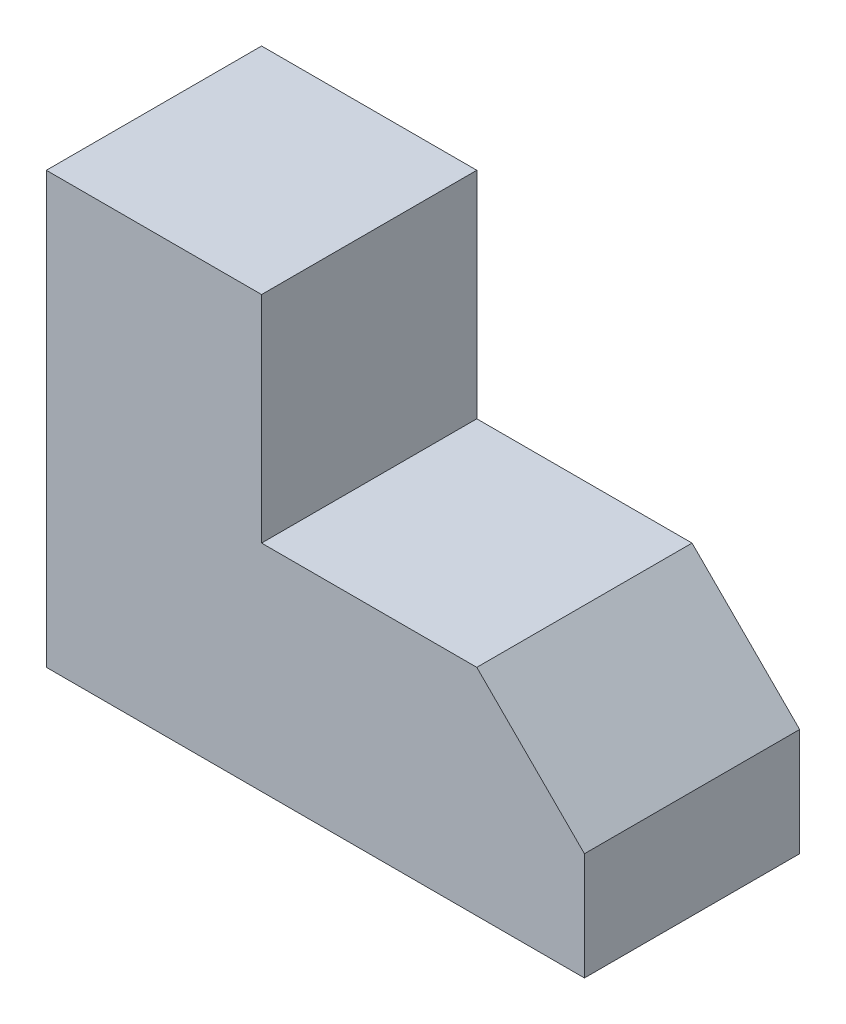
ISO-10303-21;
HEADER;
FILE_DESCRIPTION(('STEP AP214'),'2;1');
FILE_NAME('part.step','',(''),(''),'','','');
FILE_SCHEMA(('AUTOMOTIVE_DESIGN { 1 0 10303 214 1 1 1 1 }'));
ENDSEC;
DATA;
#1=APPLICATION_CONTEXT('core data for automotive mechanical design processes');
#2=APPLICATION_PROTOCOL_DEFINITION('international standard','automotive_design',2000,#1);
#3=PRODUCT_CONTEXT('',#1,'mechanical');
#4=PRODUCT('Part','Part','',(#3));
#5=PRODUCT_RELATED_PRODUCT_CATEGORY('part','',(#4));
#6=PRODUCT_DEFINITION_FORMATION('','',#4);
#7=PRODUCT_DEFINITION_CONTEXT('part definition',#1,'design');
#8=PRODUCT_DEFINITION('design','',#6,#7);
#9=PRODUCT_DEFINITION_SHAPE('','',#8);
#10=(LENGTH_UNIT() NAMED_UNIT(*) SI_UNIT(.MILLI.,.METRE.));
#11=(NAMED_UNIT(*) PLANE_ANGLE_UNIT() SI_UNIT($,.RADIAN.));
#12=(NAMED_UNIT(*) SI_UNIT($,.STERADIAN.) SOLID_ANGLE_UNIT());
#13=UNCERTAINTY_MEASURE_WITH_UNIT(LENGTH_MEASURE(1.E-05),#10,'distance_accuracy_value','');
#14=(GEOMETRIC_REPRESENTATION_CONTEXT(3) GLOBAL_UNCERTAINTY_ASSIGNED_CONTEXT((#13)) GLOBAL_UNIT_ASSIGNED_CONTEXT((#10,
#11,#12)) REPRESENTATION_CONTEXT('',''));
#15=CARTESIAN_POINT('',(0.,0.,0.));
#16=DIRECTION('',(0.,0.,1.));
#17=DIRECTION('',(1.,0.,0.));
#18=AXIS2_PLACEMENT_3D('',#15,#16,#17);
#19=CARTESIAN_POINT('',(25.,0.,10.));
#20=DIRECTION('',(0.,1.,0.));
#21=DIRECTION('',(-1.,0.,0.));
#22=AXIS2_PLACEMENT_3D('',#19,#20,#21);
#23=PLANE('',#22);
#24=DIRECTION('',(1.,0.,0.));
#25=VECTOR('',#24,1.);
#26=CARTESIAN_POINT('',(25.,0.,0.));
#27=LINE('',#26,#25);
#28=CARTESIAN_POINT('',(0.,0.,0.));
#29=VERTEX_POINT('',#28);
#30=CARTESIAN_POINT('',(25.,0.,0.));
#31=VERTEX_POINT('',#30);
#32=EDGE_CURVE('E109',#29,#31,#27,.T.);
#33=ORIENTED_EDGE('',*,*,#32,.T.);
#34=DIRECTION('',(0.,0.,-1.));
#35=VECTOR('',#34,1.);
#36=CARTESIAN_POINT('',(25.,0.,10.));
#37=LINE('',#36,#35);
#38=CARTESIAN_POINT('',(25.,0.,10.));
#39=VERTEX_POINT('',#38);
#40=EDGE_CURVE('E92',#39,#31,#37,.T.);
#41=ORIENTED_EDGE('',*,*,#40,.F.);
#42=DIRECTION('',(1.,0.,0.));
#43=VECTOR('',#42,1.);
#44=CARTESIAN_POINT('',(25.,0.,10.));
#45=LINE('',#44,#43);
#46=CARTESIAN_POINT('',(0.,0.,10.));
#47=VERTEX_POINT('',#46);
#48=EDGE_CURVE('E97',#47,#39,#45,.T.);
#49=ORIENTED_EDGE('',*,*,#48,.F.);
#50=DIRECTION('',(0.,0.,-1.));
#51=VECTOR('',#50,1.);
#52=CARTESIAN_POINT('',(0.,0.,10.));
#53=LINE('',#52,#51);
#54=EDGE_CURVE('E125',#47,#29,#53,.T.);
#55=ORIENTED_EDGE('',*,*,#54,.T.);
#56=EDGE_LOOP('',(#33,#41,#49,#55));
#57=FACE_BOUND('',#56,.T.);
#58=ADVANCED_FACE('F33',(#57),#23,.F.);
#59=CARTESIAN_POINT('',(25.,10.,10.));
#60=DIRECTION('',(-1.,0.,0.));
#61=DIRECTION('',(0.,0.,1.));
#62=AXIS2_PLACEMENT_3D('',#59,#60,#61);
#63=PLANE('',#62);
#64=DIRECTION('',(0.,1.,0.));
#65=VECTOR('',#64,1.);
#66=CARTESIAN_POINT('',(25.,10.,0.));
#67=LINE('',#66,#65);
#68=CARTESIAN_POINT('',(25.,4.99999999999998,0.));
#69=VERTEX_POINT('',#68);
#70=EDGE_CURVE('E134',#31,#69,#67,.T.);
#71=ORIENTED_EDGE('',*,*,#70,.T.);
#72=DIRECTION('',(0.,0.,1.));
#73=VECTOR('',#72,1.);
#74=CARTESIAN_POINT('',(25.,4.99999999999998,10.));
#75=LINE('',#74,#73);
#76=CARTESIAN_POINT('',(25.,4.99999999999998,10.));
#77=VERTEX_POINT('',#76);
#78=EDGE_CURVE('E41',#69,#77,#75,.T.);
#79=ORIENTED_EDGE('',*,*,#78,.T.);
#80=DIRECTION('',(0.,1.,0.));
#81=VECTOR('',#80,1.);
#82=CARTESIAN_POINT('',(25.,10.,10.));
#83=LINE('',#82,#81);
#84=EDGE_CURVE('E88',#39,#77,#83,.T.);
#85=ORIENTED_EDGE('',*,*,#84,.F.);
#86=ORIENTED_EDGE('',*,*,#40,.T.);
#87=EDGE_LOOP('',(#71,#79,#85,#86));
#88=FACE_BOUND('',#87,.T.);
#89=ADVANCED_FACE('F90',(#88),#63,.F.);
#90=CARTESIAN_POINT('',(10.,10.,10.));
#91=DIRECTION('',(0.,-1.,0.));
#92=DIRECTION('',(0.,0.,-1.));
#93=AXIS2_PLACEMENT_3D('',#90,#91,#92);
#94=PLANE('',#93);
#95=DIRECTION('',(-1.,0.,0.));
#96=VECTOR('',#95,1.);
#97=CARTESIAN_POINT('',(10.,10.,10.));
#98=LINE('',#97,#96);
#99=CARTESIAN_POINT('',(20.,10.,10.));
#100=VERTEX_POINT('',#99);
#101=CARTESIAN_POINT('',(10.,10.,10.));
#102=VERTEX_POINT('',#101);
#103=EDGE_CURVE('E96',#100,#102,#98,.T.);
#104=ORIENTED_EDGE('',*,*,#103,.F.);
#105=DIRECTION('',(0.,0.,-1.));
#106=VECTOR('',#105,1.);
#107=CARTESIAN_POINT('',(20.,10.,10.));
#108=LINE('',#107,#106);
#109=CARTESIAN_POINT('',(20.,10.,0.));
#110=VERTEX_POINT('',#109);
#111=EDGE_CURVE('E110',#100,#110,#108,.T.);
#112=ORIENTED_EDGE('',*,*,#111,.T.);
#113=DIRECTION('',(-1.,0.,0.));
#114=VECTOR('',#113,1.);
#115=CARTESIAN_POINT('',(10.,10.,0.));
#116=LINE('',#115,#114);
#117=CARTESIAN_POINT('',(10.,10.,0.));
#118=VERTEX_POINT('',#117);
#119=EDGE_CURVE('E132',#110,#118,#116,.T.);
#120=ORIENTED_EDGE('',*,*,#119,.T.);
#121=DIRECTION('',(0.,0.,-1.));
#122=VECTOR('',#121,1.);
#123=CARTESIAN_POINT('',(10.,10.,10.));
#124=LINE('',#123,#122);
#125=EDGE_CURVE('E111',#102,#118,#124,.T.);
#126=ORIENTED_EDGE('',*,*,#125,.F.);
#127=EDGE_LOOP('',(#104,#112,#120,#126));
#128=FACE_BOUND('',#127,.T.);
#129=ADVANCED_FACE('F148',(#128),#94,.F.);
#130=CARTESIAN_POINT('',(10.,20.,10.));
#131=DIRECTION('',(-1.,0.,0.));
#132=DIRECTION('',(0.,-1.,0.));
#133=AXIS2_PLACEMENT_3D('',#130,#131,#132);
#134=PLANE('',#133);
#135=DIRECTION('',(0.,1.,0.));
#136=VECTOR('',#135,1.);
#137=CARTESIAN_POINT('',(10.,20.,0.));
#138=LINE('',#137,#136);
#139=CARTESIAN_POINT('',(10.,20.,0.));
#140=VERTEX_POINT('',#139);
#141=EDGE_CURVE('E130',#118,#140,#138,.T.);
#142=ORIENTED_EDGE('',*,*,#141,.T.);
#143=DIRECTION('',(0.,0.,-1.));
#144=VECTOR('',#143,1.);
#145=CARTESIAN_POINT('',(10.,20.,10.));
#146=LINE('',#145,#144);
#147=CARTESIAN_POINT('',(10.,20.,10.));
#148=VERTEX_POINT('',#147);
#149=EDGE_CURVE('E116',#148,#140,#146,.T.);
#150=ORIENTED_EDGE('',*,*,#149,.F.);
#151=DIRECTION('',(0.,1.,0.));
#152=VECTOR('',#151,1.);
#153=CARTESIAN_POINT('',(10.,20.,10.));
#154=LINE('',#153,#152);
#155=EDGE_CURVE('E140',#102,#148,#154,.T.);
#156=ORIENTED_EDGE('',*,*,#155,.F.);
#157=ORIENTED_EDGE('',*,*,#125,.T.);
#158=EDGE_LOOP('',(#142,#150,#156,#157));
#159=FACE_BOUND('',#158,.T.);
#160=ADVANCED_FACE('F151',(#159),#134,.F.);
#161=CARTESIAN_POINT('',(0.,20.,10.));
#162=DIRECTION('',(0.,-1.,0.));
#163=DIRECTION('',(0.,0.,-1.));
#164=AXIS2_PLACEMENT_3D('',#161,#162,#163);
#165=PLANE('',#164);
#166=DIRECTION('',(-1.,0.,0.));
#167=VECTOR('',#166,1.);
#168=CARTESIAN_POINT('',(0.,20.,0.));
#169=LINE('',#168,#167);
#170=CARTESIAN_POINT('',(0.,20.,0.));
#171=VERTEX_POINT('',#170);
#172=EDGE_CURVE('E128',#140,#171,#169,.T.);
#173=ORIENTED_EDGE('',*,*,#172,.T.);
#174=DIRECTION('',(0.,0.,-1.));
#175=VECTOR('',#174,1.);
#176=CARTESIAN_POINT('',(0.,20.,10.));
#177=LINE('',#176,#175);
#178=CARTESIAN_POINT('',(0.,20.,10.));
#179=VERTEX_POINT('',#178);
#180=EDGE_CURVE('E122',#179,#171,#177,.T.);
#181=ORIENTED_EDGE('',*,*,#180,.F.);
#182=DIRECTION('',(-1.,0.,0.));
#183=VECTOR('',#182,1.);
#184=CARTESIAN_POINT('',(0.,20.,10.));
#185=LINE('',#184,#183);
#186=EDGE_CURVE('E138',#148,#179,#185,.T.);
#187=ORIENTED_EDGE('',*,*,#186,.F.);
#188=ORIENTED_EDGE('',*,*,#149,.T.);
#189=EDGE_LOOP('',(#173,#181,#187,#188));
#190=FACE_BOUND('',#189,.T.);
#191=ADVANCED_FACE('F156',(#190),#165,.F.);
#192=CARTESIAN_POINT('',(0.,0.,10.));
#193=DIRECTION('',(1.,0.,0.));
#194=DIRECTION('',(0.,0.,-1.));
#195=AXIS2_PLACEMENT_3D('',#192,#193,#194);
#196=PLANE('',#195);
#197=DIRECTION('',(0.,-1.,0.));
#198=VECTOR('',#197,1.);
#199=CARTESIAN_POINT('',(0.,0.,0.));
#200=LINE('',#199,#198);
#201=EDGE_CURVE('E106',#171,#29,#200,.T.);
#202=ORIENTED_EDGE('',*,*,#201,.T.);
#203=ORIENTED_EDGE('',*,*,#54,.F.);
#204=DIRECTION('',(0.,-1.,0.));
#205=VECTOR('',#204,1.);
#206=CARTESIAN_POINT('',(0.,0.,10.));
#207=LINE('',#206,#205);
#208=EDGE_CURVE('E102',#179,#47,#207,.T.);
#209=ORIENTED_EDGE('',*,*,#208,.F.);
#210=ORIENTED_EDGE('',*,*,#180,.T.);
#211=EDGE_LOOP('',(#202,#203,#209,#210));
#212=FACE_BOUND('',#211,.T.);
#213=ADVANCED_FACE('F159',(#212),#196,.F.);
#214=CARTESIAN_POINT('',(0.,0.,10.));
#215=DIRECTION('',(0.,0.,-1.));
#216=DIRECTION('',(-1.,0.,0.));
#217=AXIS2_PLACEMENT_3D('',#214,#215,#216);
#218=PLANE('',#217);
#219=ORIENTED_EDGE('',*,*,#84,.T.);
#220=DIRECTION('',(0.707106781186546,-0.707106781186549,0.));
#221=VECTOR('',#220,1.);
#222=CARTESIAN_POINT('',(20.,10.,10.));
#223=LINE('',#222,#221);
#224=EDGE_CURVE('E11',#77,#100,#223,.F.);
#225=ORIENTED_EDGE('',*,*,#224,.T.);
#226=ORIENTED_EDGE('',*,*,#103,.T.);
#227=ORIENTED_EDGE('',*,*,#155,.T.);
#228=ORIENTED_EDGE('',*,*,#186,.T.);
#229=ORIENTED_EDGE('',*,*,#208,.T.);
#230=ORIENTED_EDGE('',*,*,#48,.T.);
#231=EDGE_LOOP('',(#219,#225,#226,#227,#228,#229,#230));
#232=FACE_BOUND('',#231,.T.);
#233=ADVANCED_FACE('F100',(#232),#218,.F.);
#234=CARTESIAN_POINT('',(0.,0.,0.));
#235=DIRECTION('',(0.,0.,-1.));
#236=DIRECTION('',(-1.,0.,0.));
#237=AXIS2_PLACEMENT_3D('',#234,#235,#236);
#238=PLANE('',#237);
#239=ORIENTED_EDGE('',*,*,#119,.F.);
#240=DIRECTION('',(-0.707106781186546,0.707106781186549,0.));
#241=VECTOR('',#240,1.);
#242=CARTESIAN_POINT('',(15.,15.,0.));
#243=LINE('',#242,#241);
#244=EDGE_CURVE('E55',#110,#69,#243,.F.);
#245=ORIENTED_EDGE('',*,*,#244,.T.);
#246=ORIENTED_EDGE('',*,*,#70,.F.);
#247=ORIENTED_EDGE('',*,*,#32,.F.);
#248=ORIENTED_EDGE('',*,*,#201,.F.);
#249=ORIENTED_EDGE('',*,*,#172,.F.);
#250=ORIENTED_EDGE('',*,*,#141,.F.);
#251=EDGE_LOOP('',(#239,#245,#246,#247,#248,#249,#250));
#252=FACE_BOUND('',#251,.T.);
#253=ADVANCED_FACE('F160',(#252),#238,.T.);
#254=CARTESIAN_POINT('',(20.,10.,10.));
#255=DIRECTION('',(-0.707106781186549,-0.707106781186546,0.));
#256=DIRECTION('',(0.,0.,-1.));
#257=AXIS2_PLACEMENT_3D('',#254,#255,#256);
#258=PLANE('',#257);
#259=ORIENTED_EDGE('',*,*,#224,.F.);
#260=ORIENTED_EDGE('',*,*,#78,.F.);
#261=ORIENTED_EDGE('',*,*,#244,.F.);
#262=ORIENTED_EDGE('',*,*,#111,.F.);
#263=EDGE_LOOP('',(#259,#260,#261,#262));
#264=FACE_BOUND('',#263,.T.);
#265=ADVANCED_FACE('F35',(#264),#258,.F.);
#266=CLOSED_SHELL('',(#58,#89,#129,#160,#191,#213,#233,#253,#265));
#267=MANIFOLD_SOLID_BREP('B2',#266);
#268=ADVANCED_BREP_SHAPE_REPRESENTATION('',(#18,#267),#14);
#269=SHAPE_DEFINITION_REPRESENTATION(#9,#268);
ENDSEC;
END-ISO-10303-21;
